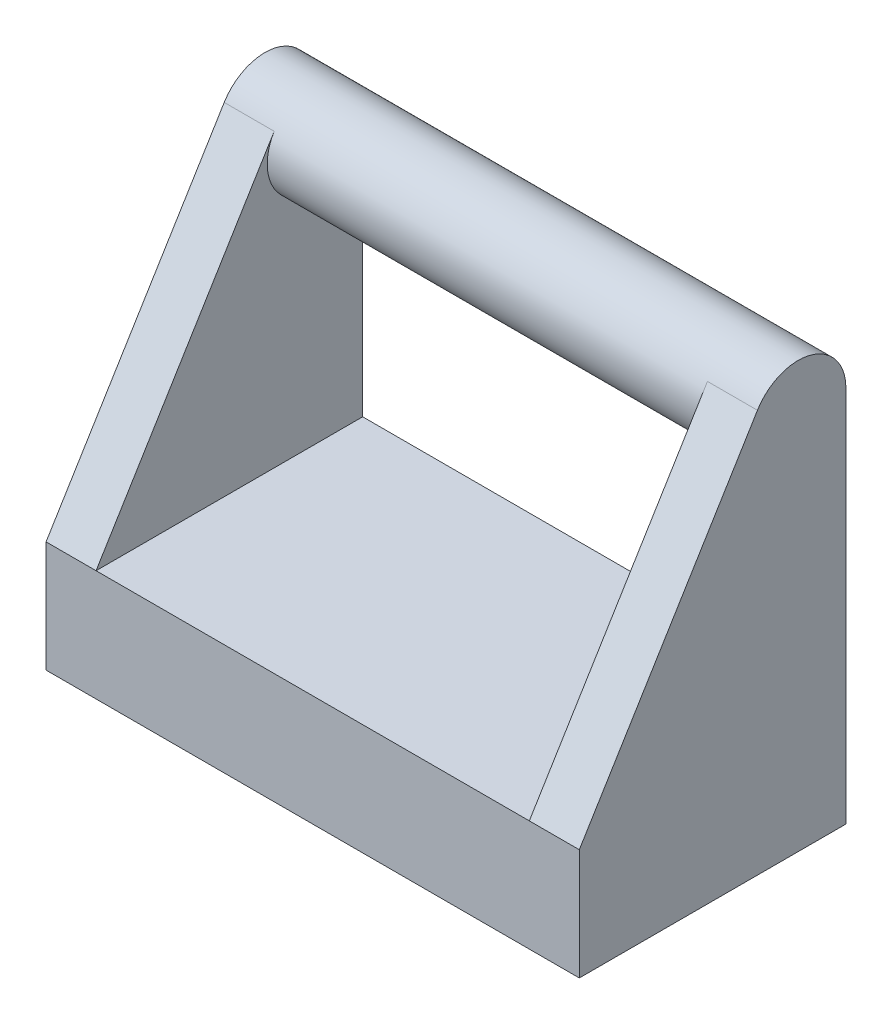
ISO-10303-21;
HEADER;
FILE_DESCRIPTION(('STEP AP214'),'2;1');
FILE_NAME('part.step','',(''),(''),'','','');
FILE_SCHEMA(('AUTOMOTIVE_DESIGN { 1 0 10303 214 1 1 1 1 }'));
ENDSEC;
DATA;
#1=APPLICATION_CONTEXT('core data for automotive mechanical design processes');
#2=APPLICATION_PROTOCOL_DEFINITION('international standard','automotive_design',2000,#1);
#3=PRODUCT_CONTEXT('',#1,'mechanical');
#4=PRODUCT('Part','Part','',(#3));
#5=PRODUCT_RELATED_PRODUCT_CATEGORY('part','',(#4));
#6=PRODUCT_DEFINITION_FORMATION('','',#4);
#7=PRODUCT_DEFINITION_CONTEXT('part definition',#1,'design');
#8=PRODUCT_DEFINITION('design','',#6,#7);
#9=PRODUCT_DEFINITION_SHAPE('','',#8);
#10=(LENGTH_UNIT() NAMED_UNIT(*) SI_UNIT(.MILLI.,.METRE.));
#11=(NAMED_UNIT(*) PLANE_ANGLE_UNIT() SI_UNIT($,.RADIAN.));
#12=(NAMED_UNIT(*) SI_UNIT($,.STERADIAN.) SOLID_ANGLE_UNIT());
#13=UNCERTAINTY_MEASURE_WITH_UNIT(LENGTH_MEASURE(1.E-05),#10,'distance_accuracy_value','');
#14=(GEOMETRIC_REPRESENTATION_CONTEXT(3) GLOBAL_UNCERTAINTY_ASSIGNED_CONTEXT((#13)) GLOBAL_UNIT_ASSIGNED_CONTEXT((#10,
#11,#12)) REPRESENTATION_CONTEXT('',''));
#15=CARTESIAN_POINT('',(0.,0.,0.));
#16=DIRECTION('',(0.,0.,1.));
#17=DIRECTION('',(1.,0.,0.));
#18=AXIS2_PLACEMENT_3D('',#15,#16,#17);
#19=CARTESIAN_POINT('',(0.,3.333333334,0.));
#20=DIRECTION('',(0.,1.,0.));
#21=DIRECTION('',(0.,0.,1.));
#22=AXIS2_PLACEMENT_3D('',#19,#20,#21);
#23=PLANE('',#22);
#24=DIRECTION('',(-1.,0.,0.));
#25=VECTOR('',#24,1.);
#26=CARTESIAN_POINT('',(0.,3.333333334,-8.));
#27=LINE('',#26,#25);
#28=CARTESIAN_POINT('',(-1.5,3.333333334,-8.));
#29=VERTEX_POINT('',#28);
#30=CARTESIAN_POINT('',(-14.5,3.333333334,-8.));
#31=VERTEX_POINT('',#30);
#32=EDGE_CURVE('E213',#29,#31,#27,.T.);
#33=ORIENTED_EDGE('',*,*,#32,.T.);
#34=DIRECTION('',(0.,0.,1.));
#35=VECTOR('',#34,1.);
#36=CARTESIAN_POINT('',(-14.5,3.333333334,0.));
#37=LINE('',#36,#35);
#38=CARTESIAN_POINT('',(-14.5,3.333333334,0.));
#39=VERTEX_POINT('',#38);
#40=EDGE_CURVE('E55',#31,#39,#37,.T.);
#41=ORIENTED_EDGE('',*,*,#40,.T.);
#42=DIRECTION('',(1.,0.,0.));
#43=VECTOR('',#42,1.);
#44=CARTESIAN_POINT('',(0.,3.333333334,0.));
#45=LINE('',#44,#43);
#46=CARTESIAN_POINT('',(-1.5,3.333333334,0.));
#47=VERTEX_POINT('',#46);
#48=EDGE_CURVE('E215',#39,#47,#45,.T.);
#49=ORIENTED_EDGE('',*,*,#48,.T.);
#50=DIRECTION('',(0.,0.,1.));
#51=VECTOR('',#50,1.);
#52=CARTESIAN_POINT('',(-1.5,3.333333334,0.));
#53=LINE('',#52,#51);
#54=EDGE_CURVE('E197',#29,#47,#53,.T.);
#55=ORIENTED_EDGE('',*,*,#54,.F.);
#56=EDGE_LOOP('',(#33,#41,#49,#55));
#57=FACE_BOUND('',#56,.T.);
#58=ADVANCED_FACE('F32',(#57),#23,.T.);
#59=CARTESIAN_POINT('',(0.,3.333333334,0.));
#60=DIRECTION('',(-1.,0.,0.));
#61=DIRECTION('',(0.,0.,1.));
#62=AXIS2_PLACEMENT_3D('',#59,#60,#61);
#63=PLANE('',#62);
#64=DIRECTION('',(0.,-1.,0.));
#65=VECTOR('',#64,1.);
#66=CARTESIAN_POINT('',(0.,3.333333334,-8.));
#67=LINE('',#66,#65);
#68=CARTESIAN_POINT('',(0.,11.333333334,-8.));
#69=VERTEX_POINT('',#68);
#70=CARTESIAN_POINT('',(0.,0.,-8.));
#71=VERTEX_POINT('',#70);
#72=EDGE_CURVE('E236',#69,#71,#67,.T.);
#73=ORIENTED_EDGE('',*,*,#72,.F.);
#74=CARTESIAN_POINT('',(0.,11.333333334,-6.5674747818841));
#75=DIRECTION('',(1.,0.,0.));
#76=DIRECTION('',(0.,0.,-1.));
#77=AXIS2_PLACEMENT_3D('',#74,#75,#76);
#78=CIRCLE('',#77,1.4325252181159);
#79=CARTESIAN_POINT('',(0.,12.0802975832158,-5.34511112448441));
#80=VERTEX_POINT('',#79);
#81=EDGE_CURVE('E188',#69,#80,#78,.T.);
#82=ORIENTED_EDGE('',*,*,#81,.T.);
#83=DIRECTION('',(0.,0.853292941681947,-0.521431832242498));
#84=VECTOR('',#83,1.);
#85=CARTESIAN_POINT('',(0.,0.906303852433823,1.48311367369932));
#86=LINE('',#85,#84);
#87=CARTESIAN_POINT('',(0.,3.333333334,0.));
#88=VERTEX_POINT('',#87);
#89=EDGE_CURVE('E194',#88,#80,#86,.T.);
#90=ORIENTED_EDGE('',*,*,#89,.F.);
#91=DIRECTION('',(0.,-1.,0.));
#92=VECTOR('',#91,1.);
#93=CARTESIAN_POINT('',(0.,3.333333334,0.));
#94=LINE('',#93,#92);
#95=CARTESIAN_POINT('',(0.,0.,0.));
#96=VERTEX_POINT('',#95);
#97=EDGE_CURVE('E220',#88,#96,#94,.T.);
#98=ORIENTED_EDGE('',*,*,#97,.T.);
#99=DIRECTION('',(0.,0.,-1.));
#100=VECTOR('',#99,1.);
#101=CARTESIAN_POINT('',(0.,0.,0.));
#102=LINE('',#101,#100);
#103=EDGE_CURVE('E208',#96,#71,#102,.T.);
#104=ORIENTED_EDGE('',*,*,#103,.T.);
#105=EDGE_LOOP('',(#73,#82,#90,#98,#104));
#106=FACE_BOUND('',#105,.T.);
#107=ADVANCED_FACE('F34',(#106),#63,.F.);
#108=CARTESIAN_POINT('',(0.,3.333333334,-8.));
#109=DIRECTION('',(0.,0.,1.));
#110=DIRECTION('',(1.,0.,0.));
#111=AXIS2_PLACEMENT_3D('',#108,#109,#110);
#112=PLANE('',#111);
#113=ORIENTED_EDGE('',*,*,#72,.T.);
#114=DIRECTION('',(-1.,0.,0.));
#115=VECTOR('',#114,1.);
#116=CARTESIAN_POINT('',(0.,0.,-8.));
#117=LINE('',#116,#115);
#118=CARTESIAN_POINT('',(-16.,0.,-8.));
#119=VERTEX_POINT('',#118);
#120=EDGE_CURVE('E223',#71,#119,#117,.T.);
#121=ORIENTED_EDGE('',*,*,#120,.T.);
#122=DIRECTION('',(0.,-1.,0.));
#123=VECTOR('',#122,1.);
#124=CARTESIAN_POINT('',(-16.,3.333333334,-8.));
#125=LINE('',#124,#123);
#126=CARTESIAN_POINT('',(-16.,11.333333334,-8.));
#127=VERTEX_POINT('',#126);
#128=EDGE_CURVE('E233',#127,#119,#125,.T.);
#129=ORIENTED_EDGE('',*,*,#128,.F.);
#130=DIRECTION('',(-1.,0.,0.));
#131=VECTOR('',#130,1.);
#132=CARTESIAN_POINT('',(-14.5,11.333333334,-8.));
#133=LINE('',#132,#131);
#134=CARTESIAN_POINT('',(-14.5,11.333333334,-8.));
#135=VERTEX_POINT('',#134);
#136=EDGE_CURVE('E185',#135,#127,#133,.T.);
#137=ORIENTED_EDGE('',*,*,#136,.F.);
#138=DIRECTION('',(0.,1.,0.));
#139=VECTOR('',#138,1.);
#140=CARTESIAN_POINT('',(-14.5,0.,-8.));
#141=LINE('',#140,#139);
#142=EDGE_CURVE('E172',#31,#135,#141,.T.);
#143=ORIENTED_EDGE('',*,*,#142,.F.);
#144=ORIENTED_EDGE('',*,*,#32,.F.);
#145=DIRECTION('',(0.,1.,0.));
#146=VECTOR('',#145,1.);
#147=CARTESIAN_POINT('',(-1.5,0.,-8.));
#148=LINE('',#147,#146);
#149=CARTESIAN_POINT('',(-1.5,11.333333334,-8.));
#150=VERTEX_POINT('',#149);
#151=EDGE_CURVE('E190',#29,#150,#148,.T.);
#152=ORIENTED_EDGE('',*,*,#151,.T.);
#153=DIRECTION('',(1.,0.,0.));
#154=VECTOR('',#153,1.);
#155=CARTESIAN_POINT('',(-1.5,11.333333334,-8.));
#156=LINE('',#155,#154);
#157=EDGE_CURVE('E200',#150,#69,#156,.T.);
#158=ORIENTED_EDGE('',*,*,#157,.T.);
#159=EDGE_LOOP('',(#113,#121,#129,#137,#143,#144,#152,#158));
#160=FACE_BOUND('',#159,.T.);
#161=ADVANCED_FACE('F273',(#160),#112,.F.);
#162=CARTESIAN_POINT('',(-16.,3.333333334,0.));
#163=DIRECTION('',(1.,0.,0.));
#164=DIRECTION('',(0.,0.,-1.));
#165=AXIS2_PLACEMENT_3D('',#162,#163,#164);
#166=PLANE('',#165);
#167=DIRECTION('',(0.,0.853292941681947,-0.521431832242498));
#168=VECTOR('',#167,1.);
#169=CARTESIAN_POINT('',(-16.,0.906303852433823,1.48311367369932));
#170=LINE('',#169,#168);
#171=CARTESIAN_POINT('',(-16.,3.333333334,0.));
#172=VERTEX_POINT('',#171);
#173=CARTESIAN_POINT('',(-16.,12.0802975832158,-5.34511112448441));
#174=VERTEX_POINT('',#173);
#175=EDGE_CURVE('E171',#172,#174,#170,.T.);
#176=ORIENTED_EDGE('',*,*,#175,.T.);
#177=CARTESIAN_POINT('',(-16.,11.333333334,-6.5674747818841));
#178=DIRECTION('',(1.,0.,0.));
#179=DIRECTION('',(0.,0.,-1.));
#180=AXIS2_PLACEMENT_3D('',#177,#178,#179);
#181=CIRCLE('',#180,1.4325252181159);
#182=EDGE_CURVE('E175',#127,#174,#181,.T.);
#183=ORIENTED_EDGE('',*,*,#182,.F.);
#184=ORIENTED_EDGE('',*,*,#128,.T.);
#185=DIRECTION('',(0.,0.,1.));
#186=VECTOR('',#185,1.);
#187=CARTESIAN_POINT('',(-16.,0.,0.));
#188=LINE('',#187,#186);
#189=CARTESIAN_POINT('',(-16.,0.,0.));
#190=VERTEX_POINT('',#189);
#191=EDGE_CURVE('E225',#119,#190,#188,.T.);
#192=ORIENTED_EDGE('',*,*,#191,.T.);
#193=DIRECTION('',(0.,-1.,0.));
#194=VECTOR('',#193,1.);
#195=CARTESIAN_POINT('',(-16.,3.333333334,0.));
#196=LINE('',#195,#194);
#197=EDGE_CURVE('E230',#172,#190,#196,.T.);
#198=ORIENTED_EDGE('',*,*,#197,.F.);
#199=EDGE_LOOP('',(#176,#183,#184,#192,#198));
#200=FACE_BOUND('',#199,.T.);
#201=ADVANCED_FACE('F255',(#200),#166,.F.);
#202=CARTESIAN_POINT('',(0.,3.333333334,0.));
#203=DIRECTION('',(0.,0.,-1.));
#204=DIRECTION('',(-1.,0.,0.));
#205=AXIS2_PLACEMENT_3D('',#202,#203,#204);
#206=PLANE('',#205);
#207=DIRECTION('',(1.,0.,0.));
#208=VECTOR('',#207,1.);
#209=CARTESIAN_POINT('',(0.,0.,0.));
#210=LINE('',#209,#208);
#211=EDGE_CURVE('E216',#190,#96,#210,.T.);
#212=ORIENTED_EDGE('',*,*,#211,.T.);
#213=ORIENTED_EDGE('',*,*,#97,.F.);
#214=DIRECTION('',(1.,0.,0.));
#215=VECTOR('',#214,1.);
#216=CARTESIAN_POINT('',(-1.5,3.333333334,0.));
#217=LINE('',#216,#215);
#218=EDGE_CURVE('E205',#47,#88,#217,.T.);
#219=ORIENTED_EDGE('',*,*,#218,.F.);
#220=ORIENTED_EDGE('',*,*,#48,.F.);
#221=EDGE_CURVE('E217',#172,#39,#45,.T.);
#222=ORIENTED_EDGE('',*,*,#221,.F.);
#223=ORIENTED_EDGE('',*,*,#197,.T.);
#224=EDGE_LOOP('',(#212,#213,#219,#220,#222,#223));
#225=FACE_BOUND('',#224,.T.);
#226=ADVANCED_FACE('F251',(#225),#206,.F.);
#227=CARTESIAN_POINT('',(0.,0.,0.));
#228=DIRECTION('',(0.,1.,0.));
#229=DIRECTION('',(0.,0.,1.));
#230=AXIS2_PLACEMENT_3D('',#227,#228,#229);
#231=PLANE('',#230);
#232=DIRECTION('',(-1.,0.,0.));
#233=VECTOR('',#232,1.);
#234=CARTESIAN_POINT('',(-1.,0.,-0.999999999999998));
#235=LINE('',#234,#233);
#236=CARTESIAN_POINT('',(-1.,0.,-0.999999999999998));
#237=VERTEX_POINT('',#236);
#238=CARTESIAN_POINT('',(-15.,0.,-1.));
#239=VERTEX_POINT('',#238);
#240=EDGE_CURVE('E159',#237,#239,#235,.T.);
#241=ORIENTED_EDGE('',*,*,#240,.F.);
#242=DIRECTION('',(0.,0.,1.));
#243=VECTOR('',#242,1.);
#244=CARTESIAN_POINT('',(-1.,0.,-7.));
#245=LINE('',#244,#243);
#246=CARTESIAN_POINT('',(-1.,0.,-7.));
#247=VERTEX_POINT('',#246);
#248=EDGE_CURVE('E47',#247,#237,#245,.T.);
#249=ORIENTED_EDGE('',*,*,#248,.F.);
#250=DIRECTION('',(1.,0.,0.));
#251=VECTOR('',#250,1.);
#252=CARTESIAN_POINT('',(-1.,0.,-7.));
#253=LINE('',#252,#251);
#254=CARTESIAN_POINT('',(-15.,0.,-7.));
#255=VERTEX_POINT('',#254);
#256=EDGE_CURVE('E147',#255,#247,#253,.T.);
#257=ORIENTED_EDGE('',*,*,#256,.F.);
#258=DIRECTION('',(0.,0.,-1.));
#259=VECTOR('',#258,1.);
#260=CARTESIAN_POINT('',(-15.,0.,-7.));
#261=LINE('',#260,#259);
#262=EDGE_CURVE('E150',#239,#255,#261,.T.);
#263=ORIENTED_EDGE('',*,*,#262,.F.);
#264=EDGE_LOOP('',(#241,#249,#257,#263));
#265=FACE_BOUND('',#264,.T.);
#266=ORIENTED_EDGE('',*,*,#103,.F.);
#267=ORIENTED_EDGE('',*,*,#211,.F.);
#268=ORIENTED_EDGE('',*,*,#191,.F.);
#269=ORIENTED_EDGE('',*,*,#120,.F.);
#270=EDGE_LOOP('',(#266,#267,#268,#269));
#271=FACE_BOUND('',#270,.T.);
#272=ADVANCED_FACE('F260',(#265,#271),#231,.F.);
#273=CARTESIAN_POINT('',(-1.5,0.906303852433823,1.48311367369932));
#274=DIRECTION('',(0.,-0.521431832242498,-0.853292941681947));
#275=DIRECTION('',(0.,0.853292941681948,-0.521431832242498));
#276=AXIS2_PLACEMENT_3D('',#273,#274,#275);
#277=PLANE('',#276);
#278=ORIENTED_EDGE('',*,*,#89,.T.);
#279=DIRECTION('',(1.,0.,0.));
#280=VECTOR('',#279,1.);
#281=CARTESIAN_POINT('',(-1.5,12.0802975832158,-5.34511112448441));
#282=LINE('',#281,#280);
#283=CARTESIAN_POINT('',(-1.5,12.0802975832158,-5.34511112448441));
#284=VERTEX_POINT('',#283);
#285=EDGE_CURVE('E209',#284,#80,#282,.T.);
#286=ORIENTED_EDGE('',*,*,#285,.F.);
#287=DIRECTION('',(0.,0.853292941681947,-0.521431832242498));
#288=VECTOR('',#287,1.);
#289=CARTESIAN_POINT('',(-1.5,0.906303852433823,1.48311367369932));
#290=LINE('',#289,#288);
#291=EDGE_CURVE('E193',#47,#284,#290,.T.);
#292=ORIENTED_EDGE('',*,*,#291,.F.);
#293=ORIENTED_EDGE('',*,*,#218,.T.);
#294=EDGE_LOOP('',(#278,#286,#292,#293));
#295=FACE_BOUND('',#294,.T.);
#296=ADVANCED_FACE('F266',(#295),#277,.F.);
#297=CARTESIAN_POINT('',(-1.5,11.333333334,-6.5674747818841));
#298=DIRECTION('',(1.,0.,0.));
#299=DIRECTION('',(0.,0.,-1.));
#300=AXIS2_PLACEMENT_3D('',#297,#298,#299);
#301=CYLINDRICAL_SURFACE('',#300,1.4325252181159);
#302=ORIENTED_EDGE('',*,*,#81,.F.);
#303=ORIENTED_EDGE('',*,*,#157,.F.);
#304=CARTESIAN_POINT('',(-1.5,11.333333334,-6.5674747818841));
#305=DIRECTION('',(1.,0.,0.));
#306=DIRECTION('',(0.,0.,-1.));
#307=AXIS2_PLACEMENT_3D('',#304,#305,#306);
#308=CIRCLE('',#307,1.4325252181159);
#309=EDGE_CURVE('E166',#284,#150,#308,.T.);
#310=ORIENTED_EDGE('',*,*,#309,.F.);
#311=ORIENTED_EDGE('',*,*,#285,.T.);
#312=EDGE_LOOP('',(#302,#303,#310,#311));
#313=FACE_BOUND('',#312,.T.);
#314=ORIENTED_EDGE('',*,*,#182,.T.);
#315=DIRECTION('',(-1.,0.,0.));
#316=VECTOR('',#315,1.);
#317=CARTESIAN_POINT('',(-14.5,12.0802975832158,-5.34511112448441));
#318=LINE('',#317,#316);
#319=CARTESIAN_POINT('',(-14.5,12.0802975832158,-5.34511112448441));
#320=VERTEX_POINT('',#319);
#321=EDGE_CURVE('E180',#320,#174,#318,.T.);
#322=ORIENTED_EDGE('',*,*,#321,.F.);
#323=CARTESIAN_POINT('',(-14.5,11.333333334,-6.5674747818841));
#324=DIRECTION('',(-1.,0.,0.));
#325=DIRECTION('',(0.,0.,1.));
#326=AXIS2_PLACEMENT_3D('',#323,#324,#325);
#327=CIRCLE('',#326,1.4325252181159);
#328=EDGE_CURVE('E40',#135,#320,#327,.T.);
#329=ORIENTED_EDGE('',*,*,#328,.F.);
#330=ORIENTED_EDGE('',*,*,#136,.T.);
#331=EDGE_LOOP('',(#314,#322,#329,#330));
#332=FACE_BOUND('',#331,.T.);
#333=ADVANCED_FACE('F244',(#313,#332),#301,.T.);
#334=CARTESIAN_POINT('',(-1.5,0.,0.));
#335=DIRECTION('',(1.,0.,0.));
#336=DIRECTION('',(0.,0.,-1.));
#337=AXIS2_PLACEMENT_3D('',#334,#335,#336);
#338=PLANE('',#337);
#339=ORIENTED_EDGE('',*,*,#291,.T.);
#340=ORIENTED_EDGE('',*,*,#309,.T.);
#341=ORIENTED_EDGE('',*,*,#151,.F.);
#342=ORIENTED_EDGE('',*,*,#54,.T.);
#343=EDGE_LOOP('',(#339,#340,#341,#342));
#344=FACE_BOUND('',#343,.T.);
#345=ADVANCED_FACE('F270',(#344),#338,.F.);
#346=CARTESIAN_POINT('',(-14.5,0.906303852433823,1.48311367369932));
#347=DIRECTION('',(0.,0.521431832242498,0.853292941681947));
#348=DIRECTION('',(0.,-0.853292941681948,0.521431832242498));
#349=AXIS2_PLACEMENT_3D('',#346,#347,#348);
#350=PLANE('',#349);
#351=ORIENTED_EDGE('',*,*,#175,.F.);
#352=ORIENTED_EDGE('',*,*,#221,.T.);
#353=DIRECTION('',(0.,0.853292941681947,-0.521431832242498));
#354=VECTOR('',#353,1.);
#355=CARTESIAN_POINT('',(-14.5,0.906303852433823,1.48311367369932));
#356=LINE('',#355,#354);
#357=EDGE_CURVE('E177',#39,#320,#356,.T.);
#358=ORIENTED_EDGE('',*,*,#357,.T.);
#359=ORIENTED_EDGE('',*,*,#321,.T.);
#360=EDGE_LOOP('',(#351,#352,#358,#359));
#361=FACE_BOUND('',#360,.T.);
#362=ADVANCED_FACE('F248',(#361),#350,.T.);
#363=CARTESIAN_POINT('',(-14.5,0.,0.));
#364=DIRECTION('',(-1.,0.,0.));
#365=DIRECTION('',(0.,0.,-1.));
#366=AXIS2_PLACEMENT_3D('',#363,#364,#365);
#367=PLANE('',#366);
#368=ORIENTED_EDGE('',*,*,#142,.T.);
#369=ORIENTED_EDGE('',*,*,#328,.T.);
#370=ORIENTED_EDGE('',*,*,#357,.F.);
#371=ORIENTED_EDGE('',*,*,#40,.F.);
#372=EDGE_LOOP('',(#368,#369,#370,#371));
#373=FACE_BOUND('',#372,.T.);
#374=ADVANCED_FACE('F240',(#373),#367,.F.);
#375=CARTESIAN_POINT('',(-1.,2.333334,-7.));
#376=DIRECTION('',(1.,0.,0.));
#377=DIRECTION('',(0.,0.,-1.));
#378=AXIS2_PLACEMENT_3D('',#375,#376,#377);
#379=PLANE('',#378);
#380=ORIENTED_EDGE('',*,*,#248,.T.);
#381=DIRECTION('',(0.,-1.,0.));
#382=VECTOR('',#381,1.);
#383=CARTESIAN_POINT('',(-1.,2.333334,-0.999999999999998));
#384=LINE('',#383,#382);
#385=CARTESIAN_POINT('',(-1.,2.333334,-0.999999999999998));
#386=VERTEX_POINT('',#385);
#387=EDGE_CURVE('E125',#386,#237,#384,.T.);
#388=ORIENTED_EDGE('',*,*,#387,.F.);
#389=DIRECTION('',(0.,0.,1.));
#390=VECTOR('',#389,1.);
#391=CARTESIAN_POINT('',(-1.,2.333334,-7.));
#392=LINE('',#391,#390);
#393=CARTESIAN_POINT('',(-1.,2.333334,-7.));
#394=VERTEX_POINT('',#393);
#395=EDGE_CURVE('E129',#394,#386,#392,.T.);
#396=ORIENTED_EDGE('',*,*,#395,.F.);
#397=DIRECTION('',(0.,-1.,0.));
#398=VECTOR('',#397,1.);
#399=CARTESIAN_POINT('',(-1.,2.333334,-7.));
#400=LINE('',#399,#398);
#401=EDGE_CURVE('E164',#394,#247,#400,.T.);
#402=ORIENTED_EDGE('',*,*,#401,.T.);
#403=EDGE_LOOP('',(#380,#388,#396,#402));
#404=FACE_BOUND('',#403,.T.);
#405=ADVANCED_FACE('F127',(#404),#379,.F.);
#406=CARTESIAN_POINT('',(-1.,2.333334,-7.));
#407=DIRECTION('',(0.,0.,-1.));
#408=DIRECTION('',(-1.,0.,0.));
#409=AXIS2_PLACEMENT_3D('',#406,#407,#408);
#410=PLANE('',#409);
#411=ORIENTED_EDGE('',*,*,#256,.T.);
#412=ORIENTED_EDGE('',*,*,#401,.F.);
#413=DIRECTION('',(1.,0.,0.));
#414=VECTOR('',#413,1.);
#415=CARTESIAN_POINT('',(-1.,2.333334,-7.));
#416=LINE('',#415,#414);
#417=CARTESIAN_POINT('',(-15.,2.333334,-7.));
#418=VERTEX_POINT('',#417);
#419=EDGE_CURVE('E135',#418,#394,#416,.T.);
#420=ORIENTED_EDGE('',*,*,#419,.F.);
#421=DIRECTION('',(0.,-1.,0.));
#422=VECTOR('',#421,1.);
#423=CARTESIAN_POINT('',(-15.,2.333334,-7.));
#424=LINE('',#423,#422);
#425=EDGE_CURVE('E167',#418,#255,#424,.T.);
#426=ORIENTED_EDGE('',*,*,#425,.T.);
#427=EDGE_LOOP('',(#411,#412,#420,#426));
#428=FACE_BOUND('',#427,.T.);
#429=ADVANCED_FACE('F358',(#428),#410,.F.);
#430=CARTESIAN_POINT('',(-15.,2.333334,-7.));
#431=DIRECTION('',(-1.,0.,0.));
#432=DIRECTION('',(0.,0.,1.));
#433=AXIS2_PLACEMENT_3D('',#430,#431,#432);
#434=PLANE('',#433);
#435=ORIENTED_EDGE('',*,*,#262,.T.);
#436=ORIENTED_EDGE('',*,*,#425,.F.);
#437=DIRECTION('',(0.,0.,-1.));
#438=VECTOR('',#437,1.);
#439=CARTESIAN_POINT('',(-15.,2.333334,-7.));
#440=LINE('',#439,#438);
#441=CARTESIAN_POINT('',(-15.,2.333334,-1.));
#442=VERTEX_POINT('',#441);
#443=EDGE_CURVE('E143',#442,#418,#440,.T.);
#444=ORIENTED_EDGE('',*,*,#443,.F.);
#445=DIRECTION('',(0.,-1.,0.));
#446=VECTOR('',#445,1.);
#447=CARTESIAN_POINT('',(-15.,2.333334,-1.));
#448=LINE('',#447,#446);
#449=EDGE_CURVE('E134',#442,#239,#448,.T.);
#450=ORIENTED_EDGE('',*,*,#449,.T.);
#451=EDGE_LOOP('',(#435,#436,#444,#450));
#452=FACE_BOUND('',#451,.T.);
#453=ADVANCED_FACE('F364',(#452),#434,.F.);
#454=CARTESIAN_POINT('',(-1.,2.333334,-0.999999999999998));
#455=DIRECTION('',(0.,0.,1.));
#456=DIRECTION('',(1.,0.,0.));
#457=AXIS2_PLACEMENT_3D('',#454,#455,#456);
#458=PLANE('',#457);
#459=ORIENTED_EDGE('',*,*,#240,.T.);
#460=ORIENTED_EDGE('',*,*,#449,.F.);
#461=DIRECTION('',(-1.,0.,0.));
#462=VECTOR('',#461,1.);
#463=CARTESIAN_POINT('',(-1.,2.333334,-0.999999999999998));
#464=LINE('',#463,#462);
#465=EDGE_CURVE('E138',#386,#442,#464,.T.);
#466=ORIENTED_EDGE('',*,*,#465,.F.);
#467=ORIENTED_EDGE('',*,*,#387,.T.);
#468=EDGE_LOOP('',(#459,#460,#466,#467));
#469=FACE_BOUND('',#468,.T.);
#470=ADVANCED_FACE('F139',(#469),#458,.F.);
#471=CARTESIAN_POINT('',(0.,2.333334,0.));
#472=DIRECTION('',(0.,-1.,0.));
#473=DIRECTION('',(0.,0.,-1.));
#474=AXIS2_PLACEMENT_3D('',#471,#472,#473);
#475=PLANE('',#474);
#476=CARTESIAN_POINT('',(-8.,2.333334,-4.));
#477=DIRECTION('',(0.,-1.,0.));
#478=DIRECTION('',(0.,0.,-1.));
#479=AXIS2_PLACEMENT_3D('',#476,#477,#478);
#480=CIRCLE('',#479,1.5);
#481=CARTESIAN_POINT('',(-8.,2.333334,-5.5));
#482=VERTEX_POINT('',#481);
#483=EDGE_CURVE('E153',#482,#482,#480,.T.);
#484=ORIENTED_EDGE('',*,*,#483,.F.);
#485=EDGE_LOOP('',(#484));
#486=FACE_BOUND('',#485,.T.);
#487=ORIENTED_EDGE('',*,*,#395,.T.);
#488=ORIENTED_EDGE('',*,*,#465,.T.);
#489=ORIENTED_EDGE('',*,*,#443,.T.);
#490=ORIENTED_EDGE('',*,*,#419,.T.);
#491=EDGE_LOOP('',(#487,#488,#489,#490));
#492=FACE_BOUND('',#491,.T.);
#493=ADVANCED_FACE('F145',(#486,#492),#475,.T.);
#494=CARTESIAN_POINT('',(-8.,0.,-4.));
#495=DIRECTION('',(0.,-1.,0.));
#496=DIRECTION('',(0.,0.,-1.));
#497=AXIS2_PLACEMENT_3D('',#494,#495,#496);
#498=PLANE('',#497);
#499=CARTESIAN_POINT('',(-8.,0.,-4.));
#500=DIRECTION('',(0.,-1.,0.));
#501=DIRECTION('',(0.,0.,-1.));
#502=AXIS2_PLACEMENT_3D('',#499,#500,#501);
#503=CIRCLE('',#502,1.5);
#504=CARTESIAN_POINT('',(-8.,0.,-5.5));
#505=VERTEX_POINT('',#504);
#506=EDGE_CURVE('E160',#505,#505,#503,.T.);
#507=ORIENTED_EDGE('',*,*,#506,.T.);
#508=EDGE_LOOP('',(#507));
#509=FACE_BOUND('',#508,.T.);
#510=CARTESIAN_POINT('',(-8.,0.,-4.));
#511=DIRECTION('',(0.,-1.,0.));
#512=DIRECTION('',(0.,0.,-1.));
#513=AXIS2_PLACEMENT_3D('',#510,#511,#512);
#514=CIRCLE('',#513,0.75);
#515=CARTESIAN_POINT('',(-8.,0.,-4.75));
#516=VERTEX_POINT('',#515);
#517=EDGE_CURVE('E441',#516,#516,#514,.T.);
#518=ORIENTED_EDGE('',*,*,#517,.F.);
#519=EDGE_LOOP('',(#518));
#520=FACE_BOUND('',#519,.T.);
#521=ADVANCED_FACE('F385',(#509,#520),#498,.T.);
#522=CARTESIAN_POINT('',(-8.,0.,-4.));
#523=DIRECTION('',(0.,1.,0.));
#524=DIRECTION('',(0.,0.,1.));
#525=AXIS2_PLACEMENT_3D('',#522,#523,#524);
#526=CYLINDRICAL_SURFACE('',#525,1.5);
#527=ORIENTED_EDGE('',*,*,#506,.F.);
#528=EDGE_LOOP('',(#527));
#529=FACE_BOUND('',#528,.T.);
#530=ORIENTED_EDGE('',*,*,#483,.T.);
#531=EDGE_LOOP('',(#530));
#532=FACE_BOUND('',#531,.T.);
#533=ADVANCED_FACE('F394',(#529,#532),#526,.T.);
#534=CARTESIAN_POINT('',(-8.,0.,-4.));
#535=DIRECTION('',(0.,1.,0.));
#536=DIRECTION('',(0.,0.,1.));
#537=AXIS2_PLACEMENT_3D('',#534,#535,#536);
#538=CYLINDRICAL_SURFACE('',#537,0.75);
#539=ORIENTED_EDGE('',*,*,#517,.T.);
#540=EDGE_LOOP('',(#539));
#541=FACE_BOUND('',#540,.T.);
#542=CARTESIAN_POINT('',(-8.,2.333334,-4.));
#543=DIRECTION('',(0.,-1.,0.));
#544=DIRECTION('',(0.,0.,-1.));
#545=AXIS2_PLACEMENT_3D('',#542,#543,#544);
#546=CIRCLE('',#545,0.75);
#547=CARTESIAN_POINT('',(-8.,2.333334,-4.75));
#548=VERTEX_POINT('',#547);
#549=EDGE_CURVE('E11',#548,#548,#546,.F.);
#550=ORIENTED_EDGE('',*,*,#549,.T.);
#551=EDGE_LOOP('',(#550));
#552=FACE_BOUND('',#551,.T.);
#553=ADVANCED_FACE('F402',(#541,#552),#538,.F.);
#554=ORIENTED_EDGE('',*,*,#549,.F.);
#555=EDGE_LOOP('',(#554));
#556=FACE_BOUND('',#555,.T.);
#557=ADVANCED_FACE('F388',(#556),#475,.T.);
#558=CLOSED_SHELL('',(#58,#107,#161,#201,#226,#272,#296,#333,#345,#362,#374,#405,#429,#453,#470,
#493,#521,#533,#553,#557));
#559=MANIFOLD_SOLID_BREP('B2',#558);
#560=ADVANCED_BREP_SHAPE_REPRESENTATION('',(#18,#559),#14);
#561=SHAPE_DEFINITION_REPRESENTATION(#9,#560);
ENDSEC;
END-ISO-10303-21;
